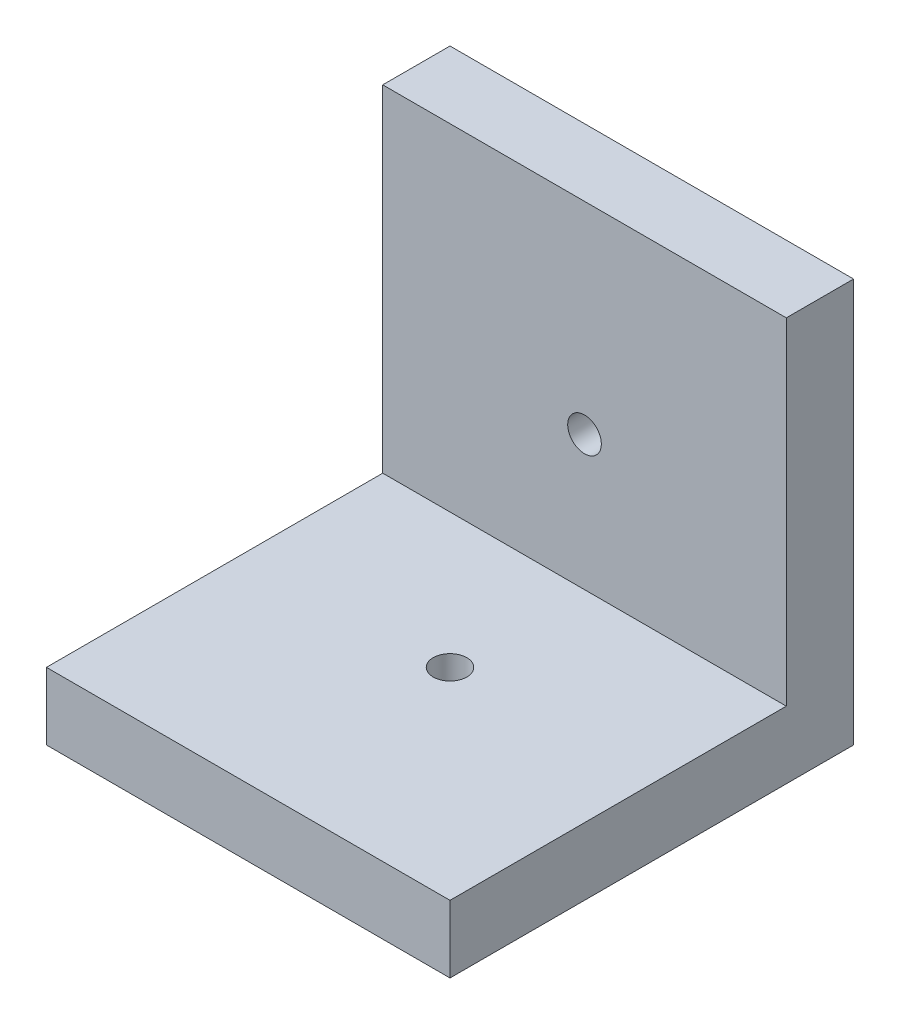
from build123d import *

# Parameters (mm, degrees)
SKETCH_1_W          = 38.1
SKETCH_1_H          = 38.1
SKETCH_1_R          = 1.5875
EXTRUDE_1_DEPTH     = 6.35
SKETCH_2_W          = 38.1
SKETCH_2_H          = 6.35
EXTRUDE_2_DEPTH     = 31.75
SKETCH_3_R          = 1.5875
CUT_EXTRUDE_1_DEPTH = 31.75


with BuildPart() as part:
    # Sketch 1 → Extrude 1 (new body)
    with BuildSketch(Plane.XY):
        Rectangle(SKETCH_1_W, SKETCH_1_H)
        Circle(SKETCH_1_R, mode=Mode.SUBTRACT)
    extrude(amount=EXTRUDE_1_DEPTH)

    # Sketch 2 → Extrude 2 (add)
    with BuildSketch(Plane.XY.offset(6.35)):
        with Locations((0, -15.875)):
            Rectangle(SKETCH_2_W, SKETCH_2_H)
    extrude(amount=EXTRUDE_2_DEPTH)

    # Sketch 3 → Cut-Extrude 1 (cut)
    with BuildSketch(Plane.XZ.offset(19.05)):
        with Locations(Location((0, 19.05, 0), (0, 0, 270))):
            Circle(SKETCH_3_R)
    extrude(amount=-CUT_EXTRUDE_1_DEPTH, mode=Mode.SUBTRACT)


solid = part.part
